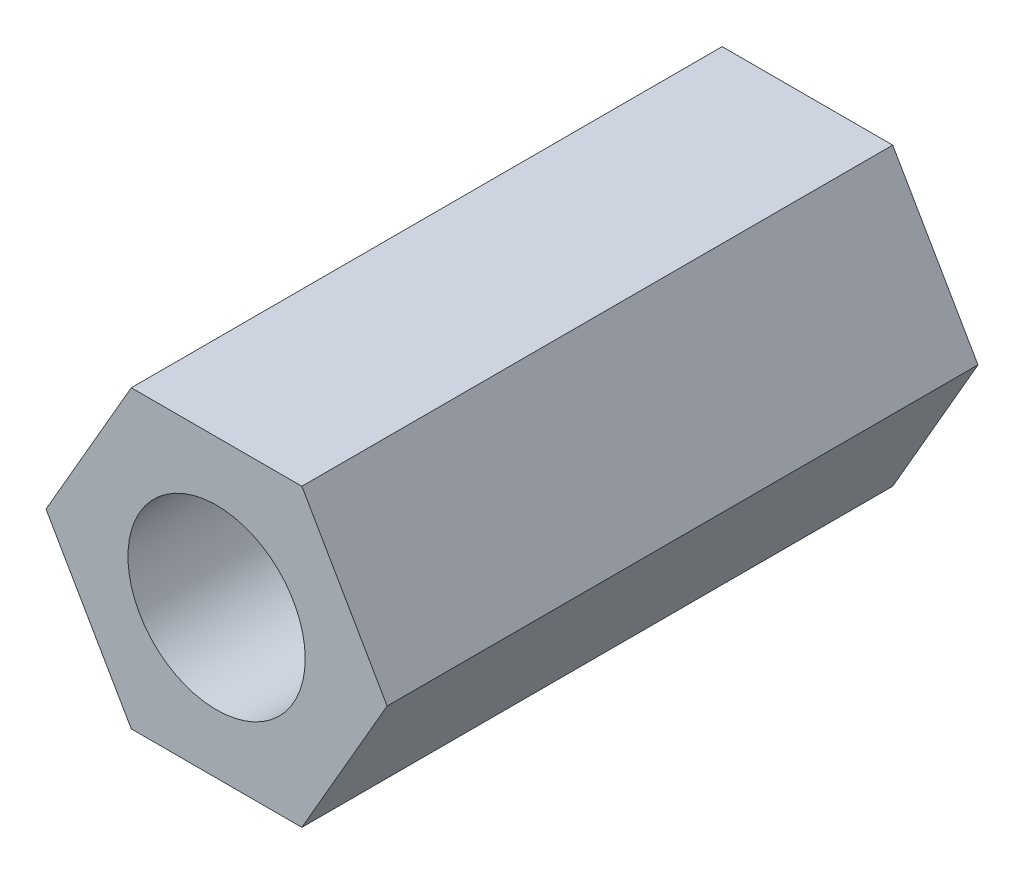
from build123d import *

# Parameters (mm, degrees)
ESQUISSE1_R      = 1.5
EXTRUSION1_DEPTH = 10


with BuildPart() as part:
    # Esquisse1 → Extrusion1 (new body)
    with BuildSketch(Plane.XY):
        Polygon((2.886751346, 0), (1.443375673, 2.5), (-1.443375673, 2.5), (-2.886751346, 0), (-1.443375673, -2.5), (1.443375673, -2.5), align=None)
        Circle(ESQUISSE1_R, mode=Mode.SUBTRACT)
    extrude(amount=EXTRUSION1_DEPTH)


solid = part.part
